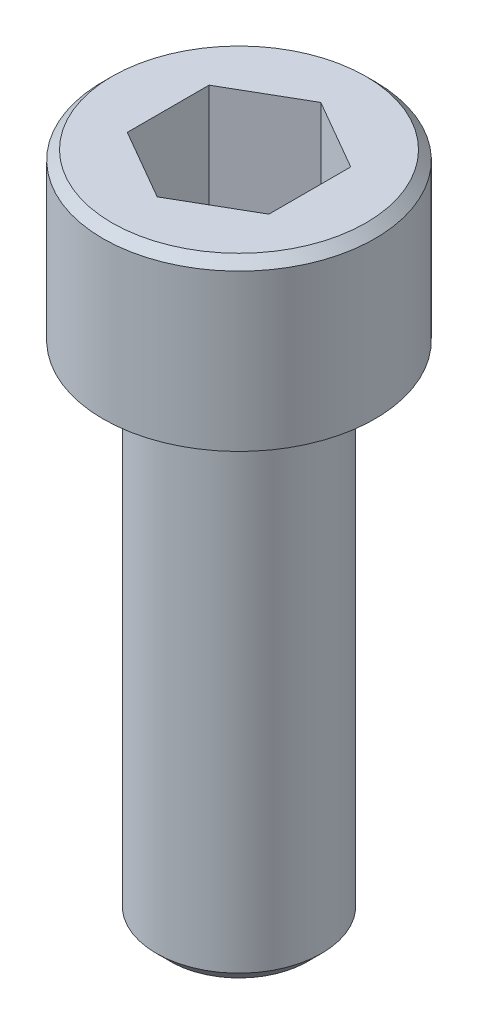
ISO-10303-21;
HEADER;
FILE_DESCRIPTION(('STEP AP214'),'2;1');
FILE_NAME('part.step','',(''),(''),'','','');
FILE_SCHEMA(('AUTOMOTIVE_DESIGN { 1 0 10303 214 1 1 1 1 }'));
ENDSEC;
DATA;
#1=APPLICATION_CONTEXT('core data for automotive mechanical design processes');
#2=APPLICATION_PROTOCOL_DEFINITION('international standard','automotive_design',2000,#1);
#3=PRODUCT_CONTEXT('',#1,'mechanical');
#4=PRODUCT('Part','Part','',(#3));
#5=PRODUCT_RELATED_PRODUCT_CATEGORY('part','',(#4));
#6=PRODUCT_DEFINITION_FORMATION('','',#4);
#7=PRODUCT_DEFINITION_CONTEXT('part definition',#1,'design');
#8=PRODUCT_DEFINITION('design','',#6,#7);
#9=PRODUCT_DEFINITION_SHAPE('','',#8);
#10=(LENGTH_UNIT() NAMED_UNIT(*) SI_UNIT(.MILLI.,.METRE.));
#11=(NAMED_UNIT(*) PLANE_ANGLE_UNIT() SI_UNIT($,.RADIAN.));
#12=(NAMED_UNIT(*) SI_UNIT($,.STERADIAN.) SOLID_ANGLE_UNIT());
#13=UNCERTAINTY_MEASURE_WITH_UNIT(LENGTH_MEASURE(1.E-05),#10,'distance_accuracy_value','');
#14=(GEOMETRIC_REPRESENTATION_CONTEXT(3) GLOBAL_UNCERTAINTY_ASSIGNED_CONTEXT((#13)) GLOBAL_UNIT_ASSIGNED_CONTEXT((#10,
#11,#12)) REPRESENTATION_CONTEXT('',''));
#15=CARTESIAN_POINT('',(0.,0.,0.));
#16=DIRECTION('',(0.,0.,1.));
#17=DIRECTION('',(1.,0.,0.));
#18=AXIS2_PLACEMENT_3D('',#15,#16,#17);
#19=CARTESIAN_POINT('',(-8.88178419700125E-13,4.16559999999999,5.32907051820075E-12));
#20=DIRECTION('',(0.,1.,0.));
#21=DIRECTION('',(0.,0.,0.999999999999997));
#22=AXIS2_PLACEMENT_3D('',#19,#20,#21);
#23=PLANE('',#22);
#24=CARTESIAN_POINT('',(-8.88178419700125E-13,4.16559999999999,5.32907051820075E-12));
#25=DIRECTION('',(0.,1.,0.));
#26=DIRECTION('',(0.,0.,0.999999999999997));
#27=AXIS2_PLACEMENT_3D('',#24,#25,#26);
#28=CIRCLE('',#27,3.2004);
#29=CARTESIAN_POINT('',(-8.88533735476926E-13,4.16559999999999,3.20040000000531));
#30=VERTEX_POINT('',#29);
#31=EDGE_CURVE('E151',#30,#30,#28,.T.);
#32=ORIENTED_EDGE('',*,*,#31,.T.);
#33=EDGE_LOOP('',(#32));
#34=FACE_BOUND('',#33,.T.);
#35=DIRECTION('',(0.,0.,-0.999999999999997));
#36=VECTOR('',#35,1.);
#37=CARTESIAN_POINT('',(-1.78593749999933,4.16559999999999,1.03111149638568));
#38=LINE('',#37,#36);
#39=CARTESIAN_POINT('',(-1.78593749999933,4.16559999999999,1.03111149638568));
#40=VERTEX_POINT('',#39);
#41=CARTESIAN_POINT('',(-1.78593750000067,4.16559999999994,-1.0311114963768));
#42=VERTEX_POINT('',#41);
#43=EDGE_CURVE('E135',#40,#42,#38,.T.);
#44=ORIENTED_EDGE('',*,*,#43,.T.);
#45=DIRECTION('',(0.866025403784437,0.,-0.499999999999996));
#46=VECTOR('',#45,1.);
#47=CARTESIAN_POINT('',(-1.78593750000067,4.16559999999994,-1.0311114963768));
#48=LINE('',#47,#46);
#49=CARTESIAN_POINT('',(0.,4.16560000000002,-2.06222299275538));
#50=VERTEX_POINT('',#49);
#51=EDGE_CURVE('E54',#42,#50,#48,.T.);
#52=ORIENTED_EDGE('',*,*,#51,.T.);
#53=DIRECTION('',(-0.866025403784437,0.,-0.499999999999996));
#54=VECTOR('',#53,1.);
#55=CARTESIAN_POINT('',(1.78593749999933,4.16559999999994,-1.03111149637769));
#56=LINE('',#55,#54);
#57=CARTESIAN_POINT('',(1.78593749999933,4.16559999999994,-1.03111149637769));
#58=VERTEX_POINT('',#57);
#59=EDGE_CURVE('E126',#58,#50,#56,.T.);
#60=ORIENTED_EDGE('',*,*,#59,.F.);
#61=DIRECTION('',(0.,0.,-0.999999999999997));
#62=VECTOR('',#61,1.);
#63=CARTESIAN_POINT('',(1.78593749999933,4.16559999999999,1.03111149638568));
#64=LINE('',#63,#62);
#65=CARTESIAN_POINT('',(1.78593749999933,4.16559999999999,1.03111149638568));
#66=VERTEX_POINT('',#65);
#67=EDGE_CURVE('E129',#66,#58,#64,.T.);
#68=ORIENTED_EDGE('',*,*,#67,.F.);
#69=DIRECTION('',(0.866025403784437,0.,-0.499999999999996));
#70=VECTOR('',#69,1.);
#71=CARTESIAN_POINT('',(-8.88178419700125E-13,4.16560000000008,2.06222299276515));
#72=LINE('',#71,#70);
#73=CARTESIAN_POINT('',(-8.88178419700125E-13,4.16560000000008,2.06222299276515));
#74=VERTEX_POINT('',#73);
#75=EDGE_CURVE('E132',#74,#66,#72,.T.);
#76=ORIENTED_EDGE('',*,*,#75,.F.);
#77=DIRECTION('',(-0.866025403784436,0.,-0.499999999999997));
#78=VECTOR('',#77,1.);
#79=CARTESIAN_POINT('',(-8.88178419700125E-13,4.16560000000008,2.06222299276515));
#80=LINE('',#79,#78);
#81=EDGE_CURVE('E102',#74,#40,#80,.T.);
#82=ORIENTED_EDGE('',*,*,#81,.T.);
#83=EDGE_LOOP('',(#44,#52,#60,#68,#76,#82));
#84=FACE_BOUND('',#83,.T.);
#85=ADVANCED_FACE('F38',(#34,#84),#23,.T.);
#86=CARTESIAN_POINT('',(0.,0.,0.));
#87=DIRECTION('',(0.,1.,0.));
#88=DIRECTION('',(0.,0.,0.999999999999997));
#89=AXIS2_PLACEMENT_3D('',#86,#87,#88);
#90=PLANE('',#89);
#91=CARTESIAN_POINT('',(0.,0.,0.));
#92=DIRECTION('',(0.,1.,0.));
#93=DIRECTION('',(0.,0.,0.999999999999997));
#94=AXIS2_PLACEMENT_3D('',#91,#92,#93);
#95=CIRCLE('',#94,3.429);
#96=CARTESIAN_POINT('',(0.,0.,3.42899999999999));
#97=VERTEX_POINT('',#96);
#98=EDGE_CURVE('E145',#97,#97,#95,.T.);
#99=ORIENTED_EDGE('',*,*,#98,.F.);
#100=EDGE_LOOP('',(#99));
#101=FACE_BOUND('',#100,.T.);
#102=CARTESIAN_POINT('',(0.,0.,0.));
#103=DIRECTION('',(0.,1.,0.));
#104=DIRECTION('',(0.,0.,0.999999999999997));
#105=AXIS2_PLACEMENT_3D('',#102,#103,#104);
#106=CIRCLE('',#105,2.0828);
#107=CARTESIAN_POINT('',(0.,0.,2.08279999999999));
#108=VERTEX_POINT('',#107);
#109=EDGE_CURVE('E148',#108,#108,#106,.F.);
#110=ORIENTED_EDGE('',*,*,#109,.F.);
#111=EDGE_LOOP('',(#110));
#112=FACE_BOUND('',#111,.T.);
#113=ADVANCED_FACE('F175',(#101,#112),#90,.F.);
#114=CARTESIAN_POINT('',(-8.88178419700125E-13,4.16559999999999,5.32907051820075E-12));
#115=DIRECTION('',(0.,-1.,0.));
#116=DIRECTION('',(0.,0.,-0.999999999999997));
#117=AXIS2_PLACEMENT_3D('',#114,#115,#116);
#118=CYLINDRICAL_SURFACE('',#117,3.429);
#119=CARTESIAN_POINT('',(0.,3.937,1.77635683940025E-12));
#120=DIRECTION('',(0.,1.,0.));
#121=DIRECTION('',(0.,0.,0.999999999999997));
#122=AXIS2_PLACEMENT_3D('',#119,#120,#121);
#123=CIRCLE('',#122,3.429);
#124=CARTESIAN_POINT('',(0.,3.937,3.42900000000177));
#125=VERTEX_POINT('',#124);
#126=EDGE_CURVE('E154',#125,#125,#123,.F.);
#127=ORIENTED_EDGE('',*,*,#126,.T.);
#128=EDGE_LOOP('',(#127));
#129=FACE_BOUND('',#128,.T.);
#130=ORIENTED_EDGE('',*,*,#98,.T.);
#131=EDGE_LOOP('',(#130));
#132=FACE_BOUND('',#131,.T.);
#133=ADVANCED_FACE('F181',(#129,#132),#118,.T.);
#134=CARTESIAN_POINT('',(4.44089209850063E-13,-12.7,5.32907051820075E-12));
#135=DIRECTION('',(0.,1.,0.));
#136=DIRECTION('',(0.,0.,0.999999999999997));
#137=AXIS2_PLACEMENT_3D('',#134,#135,#136);
#138=CYLINDRICAL_SURFACE('',#137,2.0828);
#139=CARTESIAN_POINT('',(4.44089209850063E-13,-12.3444,5.32907051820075E-12));
#140=DIRECTION('',(0.,-1.,0.));
#141=DIRECTION('',(0.,0.,-0.999999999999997));
#142=AXIS2_PLACEMENT_3D('',#139,#140,#141);
#143=CIRCLE('',#142,2.0828);
#144=CARTESIAN_POINT('',(4.44320447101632E-13,-12.3444,-2.08279999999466));
#145=VERTEX_POINT('',#144);
#146=EDGE_CURVE('E11',#145,#145,#143,.F.);
#147=ORIENTED_EDGE('',*,*,#146,.T.);
#148=EDGE_LOOP('',(#147));
#149=FACE_BOUND('',#148,.T.);
#150=ORIENTED_EDGE('',*,*,#109,.T.);
#151=EDGE_LOOP('',(#150));
#152=FACE_BOUND('',#151,.T.);
#153=ADVANCED_FACE('F186',(#149,#152),#138,.T.);
#154=CARTESIAN_POINT('',(4.44089209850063E-13,-12.7,5.32907051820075E-12));
#155=DIRECTION('',(0.,-1.,0.));
#156=DIRECTION('',(0.,0.,-0.999999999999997));
#157=AXIS2_PLACEMENT_3D('',#154,#155,#156);
#158=PLANE('',#157);
#159=CARTESIAN_POINT('',(4.44089209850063E-13,-12.7,5.32907051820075E-12));
#160=DIRECTION('',(0.,-1.,0.));
#161=DIRECTION('',(0.,0.,-0.999999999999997));
#162=AXIS2_PLACEMENT_3D('',#159,#160,#161);
#163=CIRCLE('',#162,0.762);
#164=CARTESIAN_POINT('',(4.44173808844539E-13,-12.7,-0.761999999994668));
#165=VERTEX_POINT('',#164);
#166=EDGE_CURVE('E235',#165,#165,#163,.T.);
#167=ORIENTED_EDGE('',*,*,#166,.F.);
#168=EDGE_LOOP('',(#167));
#169=FACE_BOUND('',#168,.T.);
#170=CARTESIAN_POINT('',(4.44089209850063E-13,-12.7,5.32907051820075E-12));
#171=DIRECTION('',(0.,-1.,0.));
#172=DIRECTION('',(0.,0.,-0.999999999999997));
#173=AXIS2_PLACEMENT_3D('',#170,#171,#172);
#174=CIRCLE('',#173,1.72719999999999);
#175=CARTESIAN_POINT('',(4.44280967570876E-13,-12.7,-1.72719999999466));
#176=VERTEX_POINT('',#175);
#177=EDGE_CURVE('E47',#176,#176,#174,.T.);
#178=ORIENTED_EDGE('',*,*,#177,.T.);
#179=EDGE_LOOP('',(#178));
#180=FACE_BOUND('',#179,.T.);
#181=ADVANCED_FACE('F160',(#169,#180),#158,.T.);
#182=CARTESIAN_POINT('',(-1.78593750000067,0.253999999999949,-1.03111149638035));
#183=DIRECTION('',(0.499999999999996,0.,0.866025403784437));
#184=DIRECTION('',(0.866025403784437,0.,-0.499999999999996));
#185=AXIS2_PLACEMENT_3D('',#182,#183,#184);
#186=PLANE('',#185);
#187=ORIENTED_EDGE('',*,*,#51,.F.);
#188=DIRECTION('',(0.,1.,0.));
#189=VECTOR('',#188,1.);
#190=CARTESIAN_POINT('',(-1.78593750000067,0.253999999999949,-1.03111149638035));
#191=LINE('',#190,#189);
#192=CARTESIAN_POINT('',(-1.78593750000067,0.253999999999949,-1.03111149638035));
#193=VERTEX_POINT('',#192);
#194=EDGE_CURVE('E124',#193,#42,#191,.T.);
#195=ORIENTED_EDGE('',*,*,#194,.F.);
#196=DIRECTION('',(0.866025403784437,0.,-0.499999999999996));
#197=VECTOR('',#196,1.);
#198=CARTESIAN_POINT('',(-1.78593750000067,0.253999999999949,-1.03111149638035));
#199=LINE('',#198,#197);
#200=CARTESIAN_POINT('',(-4.44089209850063E-13,0.254000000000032,-2.0622229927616));
#201=VERTEX_POINT('',#200);
#202=EDGE_CURVE('E89',#193,#201,#199,.T.);
#203=ORIENTED_EDGE('',*,*,#202,.T.);
#204=DIRECTION('',(0.,1.,0.));
#205=VECTOR('',#204,1.);
#206=CARTESIAN_POINT('',(-4.44089209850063E-13,0.254000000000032,-2.0622229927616));
#207=LINE('',#206,#205);
#208=EDGE_CURVE('E143',#201,#50,#207,.T.);
#209=ORIENTED_EDGE('',*,*,#208,.T.);
#210=EDGE_LOOP('',(#187,#195,#203,#209));
#211=FACE_BOUND('',#210,.T.);
#212=ADVANCED_FACE('F206',(#211),#186,.T.);
#213=CARTESIAN_POINT('',(1.78593749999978,0.253999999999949,-1.03111149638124));
#214=DIRECTION('',(0.499999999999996,0.,-0.866025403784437));
#215=DIRECTION('',(-0.866025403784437,0.,-0.499999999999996));
#216=AXIS2_PLACEMENT_3D('',#213,#214,#215);
#217=PLANE('',#216);
#218=ORIENTED_EDGE('',*,*,#59,.T.);
#219=ORIENTED_EDGE('',*,*,#208,.F.);
#220=DIRECTION('',(-0.866025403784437,0.,-0.499999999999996));
#221=VECTOR('',#220,1.);
#222=CARTESIAN_POINT('',(1.78593749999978,0.253999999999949,-1.03111149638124));
#223=LINE('',#222,#221);
#224=CARTESIAN_POINT('',(1.78593749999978,0.253999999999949,-1.03111149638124));
#225=VERTEX_POINT('',#224);
#226=EDGE_CURVE('E119',#225,#201,#223,.T.);
#227=ORIENTED_EDGE('',*,*,#226,.F.);
#228=DIRECTION('',(0.,1.,0.));
#229=VECTOR('',#228,1.);
#230=CARTESIAN_POINT('',(1.78593749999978,0.253999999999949,-1.03111149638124));
#231=LINE('',#230,#229);
#232=EDGE_CURVE('E141',#225,#58,#231,.T.);
#233=ORIENTED_EDGE('',*,*,#232,.T.);
#234=EDGE_LOOP('',(#218,#219,#227,#233));
#235=FACE_BOUND('',#234,.T.);
#236=ADVANCED_FACE('F211',(#235),#217,.F.);
#237=CARTESIAN_POINT('',(1.78593749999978,0.254000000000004,1.03111149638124));
#238=DIRECTION('',(0.999999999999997,0.,0.));
#239=DIRECTION('',(0.,0.,-0.999999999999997));
#240=AXIS2_PLACEMENT_3D('',#237,#238,#239);
#241=PLANE('',#240);
#242=ORIENTED_EDGE('',*,*,#67,.T.);
#243=ORIENTED_EDGE('',*,*,#232,.F.);
#244=DIRECTION('',(0.,0.,-0.999999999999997));
#245=VECTOR('',#244,1.);
#246=CARTESIAN_POINT('',(1.78593749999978,0.254000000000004,1.03111149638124));
#247=LINE('',#246,#245);
#248=CARTESIAN_POINT('',(1.78593749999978,0.254000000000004,1.03111149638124));
#249=VERTEX_POINT('',#248);
#250=EDGE_CURVE('E117',#249,#225,#247,.T.);
#251=ORIENTED_EDGE('',*,*,#250,.F.);
#252=DIRECTION('',(0.,1.,0.));
#253=VECTOR('',#252,1.);
#254=CARTESIAN_POINT('',(1.78593749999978,0.254000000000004,1.03111149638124));
#255=LINE('',#254,#253);
#256=EDGE_CURVE('E107',#249,#66,#255,.T.);
#257=ORIENTED_EDGE('',*,*,#256,.T.);
#258=EDGE_LOOP('',(#242,#243,#251,#257));
#259=FACE_BOUND('',#258,.T.);
#260=ADVANCED_FACE('F217',(#259),#241,.F.);
#261=CARTESIAN_POINT('',(-1.33226762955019E-12,0.254000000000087,2.06222299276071));
#262=DIRECTION('',(0.499999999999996,0.,0.866025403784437));
#263=DIRECTION('',(0.866025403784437,0.,-0.499999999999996));
#264=AXIS2_PLACEMENT_3D('',#261,#262,#263);
#265=PLANE('',#264);
#266=ORIENTED_EDGE('',*,*,#75,.T.);
#267=ORIENTED_EDGE('',*,*,#256,.F.);
#268=DIRECTION('',(0.866025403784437,0.,-0.499999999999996));
#269=VECTOR('',#268,1.);
#270=CARTESIAN_POINT('',(-1.33226762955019E-12,0.254000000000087,2.06222299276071));
#271=LINE('',#270,#269);
#272=CARTESIAN_POINT('',(-1.33226762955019E-12,0.254000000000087,2.06222299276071));
#273=VERTEX_POINT('',#272);
#274=EDGE_CURVE('E113',#273,#249,#271,.T.);
#275=ORIENTED_EDGE('',*,*,#274,.F.);
#276=DIRECTION('',(0.,1.,0.));
#277=VECTOR('',#276,1.);
#278=CARTESIAN_POINT('',(-1.33226762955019E-12,0.254000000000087,2.06222299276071));
#279=LINE('',#278,#277);
#280=EDGE_CURVE('E97',#273,#74,#279,.T.);
#281=ORIENTED_EDGE('',*,*,#280,.T.);
#282=EDGE_LOOP('',(#266,#267,#275,#281));
#283=FACE_BOUND('',#282,.T.);
#284=ADVANCED_FACE('F115',(#283),#265,.F.);
#285=CARTESIAN_POINT('',(-1.33226762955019E-12,0.254000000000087,2.06222299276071));
#286=DIRECTION('',(0.499999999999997,0.,-0.866025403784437));
#287=DIRECTION('',(-0.866025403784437,0.,-0.499999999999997));
#288=AXIS2_PLACEMENT_3D('',#285,#286,#287);
#289=PLANE('',#288);
#290=ORIENTED_EDGE('',*,*,#81,.F.);
#291=ORIENTED_EDGE('',*,*,#280,.F.);
#292=DIRECTION('',(-0.866025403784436,0.,-0.499999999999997));
#293=VECTOR('',#292,1.);
#294=CARTESIAN_POINT('',(-1.33226762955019E-12,0.254000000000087,2.06222299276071));
#295=LINE('',#294,#293);
#296=CARTESIAN_POINT('',(-1.78593750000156,0.254000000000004,1.03111149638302));
#297=VERTEX_POINT('',#296);
#298=EDGE_CURVE('E100',#273,#297,#295,.T.);
#299=ORIENTED_EDGE('',*,*,#298,.T.);
#300=DIRECTION('',(0.,1.,0.));
#301=VECTOR('',#300,1.);
#302=CARTESIAN_POINT('',(-1.78593750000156,0.254000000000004,1.03111149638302));
#303=LINE('',#302,#301);
#304=EDGE_CURVE('E83',#297,#40,#303,.T.);
#305=ORIENTED_EDGE('',*,*,#304,.T.);
#306=EDGE_LOOP('',(#290,#291,#299,#305));
#307=FACE_BOUND('',#306,.T.);
#308=ADVANCED_FACE('F99',(#307),#289,.T.);
#309=CARTESIAN_POINT('',(-1.78593750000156,0.254000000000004,1.03111149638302));
#310=DIRECTION('',(0.999999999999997,0.,0.));
#311=DIRECTION('',(0.,0.,-0.999999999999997));
#312=AXIS2_PLACEMENT_3D('',#309,#310,#311);
#313=PLANE('',#312);
#314=ORIENTED_EDGE('',*,*,#43,.F.);
#315=ORIENTED_EDGE('',*,*,#304,.F.);
#316=DIRECTION('',(0.,0.,-0.999999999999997));
#317=VECTOR('',#316,1.);
#318=CARTESIAN_POINT('',(-1.78593750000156,0.254000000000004,1.03111149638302));
#319=LINE('',#318,#317);
#320=EDGE_CURVE('E62',#297,#193,#319,.T.);
#321=ORIENTED_EDGE('',*,*,#320,.T.);
#322=ORIENTED_EDGE('',*,*,#194,.T.);
#323=EDGE_LOOP('',(#314,#315,#321,#322));
#324=FACE_BOUND('',#323,.T.);
#325=ADVANCED_FACE('F226',(#324),#313,.T.);
#326=CARTESIAN_POINT('',(1.78593749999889,0.254000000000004,-3.09333448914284));
#327=DIRECTION('',(0.,1.,0.));
#328=DIRECTION('',(0.,0.,0.999999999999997));
#329=AXIS2_PLACEMENT_3D('',#326,#327,#328);
#330=PLANE('',#329);
#331=CARTESIAN_POINT('',(4.44089209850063E-13,0.254000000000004,0.));
#332=DIRECTION('',(0.,1.,0.));
#333=DIRECTION('',(0.,0.,0.999999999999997));
#334=AXIS2_PLACEMENT_3D('',#331,#332,#333);
#335=CIRCLE('',#334,0.762);
#336=CARTESIAN_POINT('',(4.44004610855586E-13,0.254000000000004,0.761999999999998));
#337=VERTEX_POINT('',#336);
#338=EDGE_CURVE('E42',#337,#337,#335,.T.);
#339=ORIENTED_EDGE('',*,*,#338,.F.);
#340=EDGE_LOOP('',(#339));
#341=FACE_BOUND('',#340,.T.);
#342=ORIENTED_EDGE('',*,*,#202,.F.);
#343=ORIENTED_EDGE('',*,*,#320,.F.);
#344=ORIENTED_EDGE('',*,*,#298,.F.);
#345=ORIENTED_EDGE('',*,*,#274,.T.);
#346=ORIENTED_EDGE('',*,*,#250,.T.);
#347=ORIENTED_EDGE('',*,*,#226,.T.);
#348=EDGE_LOOP('',(#342,#343,#344,#345,#346,#347));
#349=FACE_BOUND('',#348,.T.);
#350=ADVANCED_FACE('F111',(#341,#349),#330,.T.);
#351=CARTESIAN_POINT('',(-8.88178419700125E-13,4.16559999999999,5.32907051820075E-12));
#352=DIRECTION('',(0.,-1.,0.));
#353=DIRECTION('',(0.,0.,-0.999999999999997));
#354=AXIS2_PLACEMENT_3D('',#351,#352,#353);
#355=CONICAL_SURFACE('',#354,3.2004,0.785398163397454);
#356=ORIENTED_EDGE('',*,*,#126,.F.);
#357=EDGE_LOOP('',(#356));
#358=FACE_BOUND('',#357,.T.);
#359=ORIENTED_EDGE('',*,*,#31,.F.);
#360=EDGE_LOOP('',(#359));
#361=FACE_BOUND('',#360,.T.);
#362=ADVANCED_FACE('F164',(#358,#361),#355,.T.);
#363=CARTESIAN_POINT('',(4.44089209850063E-13,-12.7,5.32907051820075E-12));
#364=DIRECTION('',(0.,1.,0.));
#365=DIRECTION('',(0.,0.,0.999999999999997));
#366=AXIS2_PLACEMENT_3D('',#363,#364,#365);
#367=CONICAL_SURFACE('',#366,1.72719999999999,0.785398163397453);
#368=ORIENTED_EDGE('',*,*,#146,.F.);
#369=EDGE_LOOP('',(#368));
#370=FACE_BOUND('',#369,.T.);
#371=ORIENTED_EDGE('',*,*,#177,.F.);
#372=EDGE_LOOP('',(#371));
#373=FACE_BOUND('',#372,.T.);
#374=ADVANCED_FACE('F40',(#370,#373),#367,.T.);
#375=CARTESIAN_POINT('',(-8.88178419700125E-13,4.16559999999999,5.32907051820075E-12));
#376=DIRECTION('',(0.,-1.,0.));
#377=DIRECTION('',(0.,0.,-0.999999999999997));
#378=AXIS2_PLACEMENT_3D('',#375,#376,#377);
#379=CYLINDRICAL_SURFACE('',#378,0.762);
#380=ORIENTED_EDGE('',*,*,#338,.T.);
#381=EDGE_LOOP('',(#380));
#382=FACE_BOUND('',#381,.T.);
#383=ORIENTED_EDGE('',*,*,#166,.T.);
#384=EDGE_LOOP('',(#383));
#385=FACE_BOUND('',#384,.T.);
#386=ADVANCED_FACE('F163',(#382,#385),#379,.F.);
#387=CLOSED_SHELL('',(#85,#113,#133,#153,#181,#212,#236,#260,#284,#308,#325,#350,#362,#374,#386));
#388=MANIFOLD_SOLID_BREP('B2',#387);
#389=ADVANCED_BREP_SHAPE_REPRESENTATION('',(#18,#388),#14);
#390=SHAPE_DEFINITION_REPRESENTATION(#9,#389);
ENDSEC;
END-ISO-10303-21;
